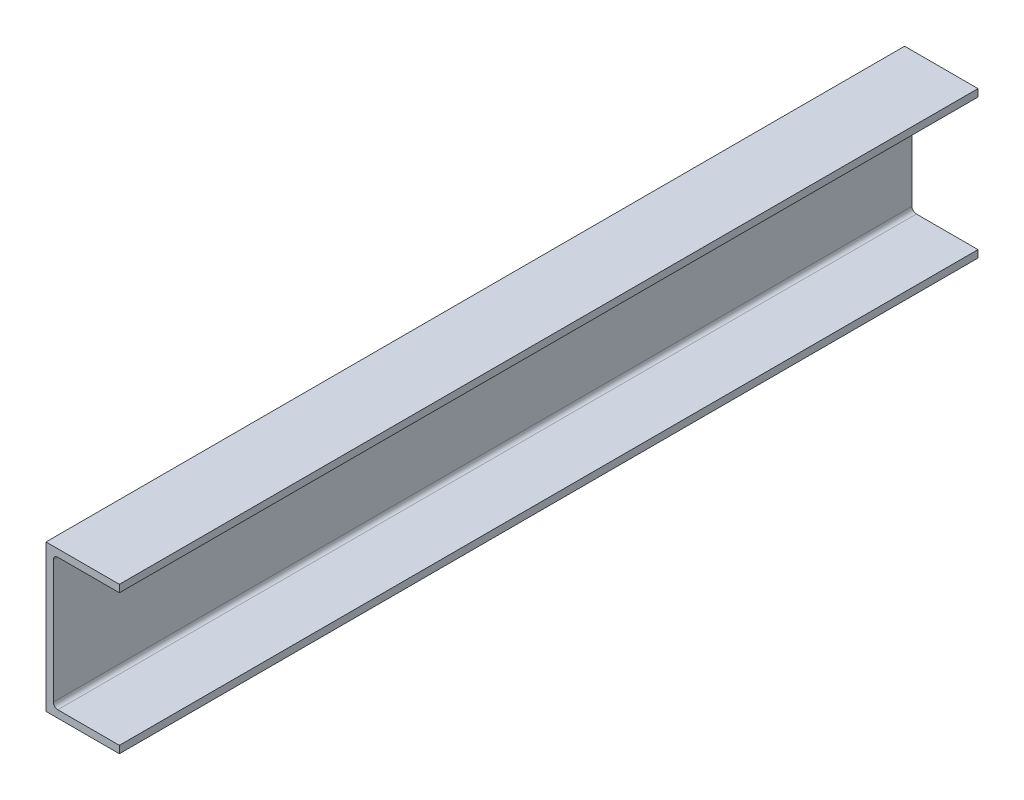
from build123d import *

# Parameters (mm, degrees)
EXTRUDE_2_DEPTH = 585


with BuildPart() as part:
    # Sketch 1 → Extrude 2 (new body)
    with BuildSketch(Plane.XY):
        with BuildLine():
            ThreePointArc((8, -5), (5.878679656, -5.878679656), (5, -8))
            Line((5, -8), (5, -92))
            ThreePointArc((5, -92), (5.878679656, -94.121320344), (8, -95))
            Line((8, -95), (50, -95))
            Line((50, -95), (50, -100))
            Line((50, -100), (0, -100))
            Line((0, -100), (0, 0))
            Line((0, 0), (50, 0))
            Line((50, 0), (50, -5))
            Line((50, -5), (8, -5))
        make_face()
    extrude(amount=EXTRUDE_2_DEPTH)


solid = part.part
